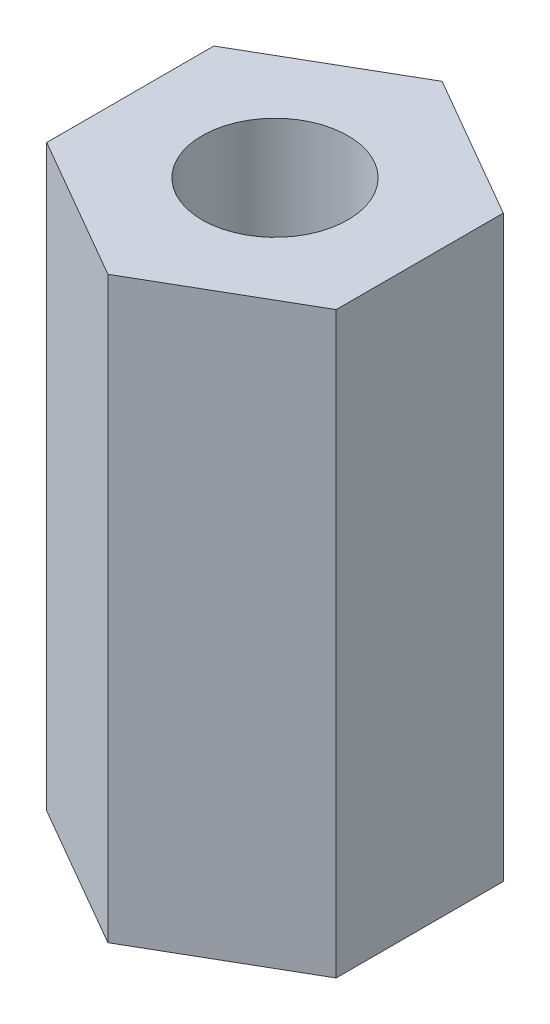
ISO-10303-21;
HEADER;
FILE_DESCRIPTION(('STEP AP214'),'2;1');
FILE_NAME('part.step','',(''),(''),'','','');
FILE_SCHEMA(('AUTOMOTIVE_DESIGN { 1 0 10303 214 1 1 1 1 }'));
ENDSEC;
DATA;
#1=APPLICATION_CONTEXT('core data for automotive mechanical design processes');
#2=APPLICATION_PROTOCOL_DEFINITION('international standard','automotive_design',2000,#1);
#3=PRODUCT_CONTEXT('',#1,'mechanical');
#4=PRODUCT('Part','Part','',(#3));
#5=PRODUCT_RELATED_PRODUCT_CATEGORY('part','',(#4));
#6=PRODUCT_DEFINITION_FORMATION('','',#4);
#7=PRODUCT_DEFINITION_CONTEXT('part definition',#1,'design');
#8=PRODUCT_DEFINITION('design','',#6,#7);
#9=PRODUCT_DEFINITION_SHAPE('','',#8);
#10=(LENGTH_UNIT() NAMED_UNIT(*) SI_UNIT(.MILLI.,.METRE.));
#11=(NAMED_UNIT(*) PLANE_ANGLE_UNIT() SI_UNIT($,.RADIAN.));
#12=(NAMED_UNIT(*) SI_UNIT($,.STERADIAN.) SOLID_ANGLE_UNIT());
#13=UNCERTAINTY_MEASURE_WITH_UNIT(LENGTH_MEASURE(1.E-05),#10,'distance_accuracy_value','');
#14=(GEOMETRIC_REPRESENTATION_CONTEXT(3) GLOBAL_UNCERTAINTY_ASSIGNED_CONTEXT((#13)) GLOBAL_UNIT_ASSIGNED_CONTEXT((#10,
#11,#12)) REPRESENTATION_CONTEXT('',''));
#15=CARTESIAN_POINT('',(0.,0.,0.));
#16=DIRECTION('',(0.,0.,1.));
#17=DIRECTION('',(1.,0.,0.));
#18=AXIS2_PLACEMENT_3D('',#15,#16,#17);
#19=CARTESIAN_POINT('',(12.7,25.4,0.));
#20=DIRECTION('',(0.,-1.,0.));
#21=DIRECTION('',(0.,0.,-1.));
#22=AXIS2_PLACEMENT_3D('',#19,#20,#21);
#23=PLANE('',#22);
#24=DIRECTION('',(-0.866025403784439,0.,-0.5));
#25=VECTOR('',#24,1.);
#26=CARTESIAN_POINT('',(6.35,25.4,-3.66617420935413));
#27=LINE('',#26,#25);
#28=CARTESIAN_POINT('',(6.35,25.4,-3.66617420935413));
#29=VERTEX_POINT('',#28);
#30=CARTESIAN_POINT('',(0.,25.4,-7.33234841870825));
#31=VERTEX_POINT('',#30);
#32=EDGE_CURVE('E120',#29,#31,#27,.T.);
#33=ORIENTED_EDGE('',*,*,#32,.T.);
#34=DIRECTION('',(-0.866025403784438,0.,0.5));
#35=VECTOR('',#34,1.);
#36=CARTESIAN_POINT('',(0.,25.4,-7.33234841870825));
#37=LINE('',#36,#35);
#38=CARTESIAN_POINT('',(-6.35,25.4,-3.66617420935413));
#39=VERTEX_POINT('',#38);
#40=EDGE_CURVE('E101',#31,#39,#37,.T.);
#41=ORIENTED_EDGE('',*,*,#40,.T.);
#42=DIRECTION('',(0.,0.,1.));
#43=VECTOR('',#42,1.);
#44=CARTESIAN_POINT('',(-6.35,25.4,-3.66617420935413));
#45=LINE('',#44,#43);
#46=CARTESIAN_POINT('',(-6.35,25.4,3.66617420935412));
#47=VERTEX_POINT('',#46);
#48=EDGE_CURVE('E123',#39,#47,#45,.T.);
#49=ORIENTED_EDGE('',*,*,#48,.T.);
#50=DIRECTION('',(0.866025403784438,0.,0.5));
#51=VECTOR('',#50,1.);
#52=CARTESIAN_POINT('',(-6.35,25.4,3.66617420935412));
#53=LINE('',#52,#51);
#54=CARTESIAN_POINT('',(0.,25.4,7.33234841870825));
#55=VERTEX_POINT('',#54);
#56=EDGE_CURVE('E125',#47,#55,#53,.T.);
#57=ORIENTED_EDGE('',*,*,#56,.T.);
#58=DIRECTION('',(0.866025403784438,0.,-0.5));
#59=VECTOR('',#58,1.);
#60=CARTESIAN_POINT('',(0.,25.4,7.33234841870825));
#61=LINE('',#60,#59);
#62=CARTESIAN_POINT('',(6.35,25.4,3.66617420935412));
#63=VERTEX_POINT('',#62);
#64=EDGE_CURVE('E54',#55,#63,#61,.T.);
#65=ORIENTED_EDGE('',*,*,#64,.T.);
#66=DIRECTION('',(0.,0.,-1.));
#67=VECTOR('',#66,1.);
#68=CARTESIAN_POINT('',(6.35,25.4,3.66617420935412));
#69=LINE('',#68,#67);
#70=EDGE_CURVE('E49',#63,#29,#69,.T.);
#71=ORIENTED_EDGE('',*,*,#70,.T.);
#72=EDGE_LOOP('',(#33,#41,#49,#57,#65,#71));
#73=FACE_BOUND('',#72,.T.);
#74=CARTESIAN_POINT('',(0.,25.4,0.));
#75=DIRECTION('',(0.,1.,0.));
#76=DIRECTION('',(0.,0.,1.));
#77=AXIS2_PLACEMENT_3D('',#74,#75,#76);
#78=CIRCLE('',#77,3.2004);
#79=CARTESIAN_POINT('',(0.,25.4,3.2004));
#80=VERTEX_POINT('',#79);
#81=EDGE_CURVE('E106',#80,#80,#78,.T.);
#82=ORIENTED_EDGE('',*,*,#81,.F.);
#83=EDGE_LOOP('',(#82));
#84=FACE_BOUND('',#83,.T.);
#85=ADVANCED_FACE('F34',(#73,#84),#23,.F.);
#86=CARTESIAN_POINT('',(12.7,0.,0.));
#87=DIRECTION('',(0.,-1.,0.));
#88=DIRECTION('',(0.,0.,-1.));
#89=AXIS2_PLACEMENT_3D('',#86,#87,#88);
#90=PLANE('',#89);
#91=DIRECTION('',(-0.866025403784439,0.,-0.5));
#92=VECTOR('',#91,1.);
#93=CARTESIAN_POINT('',(6.35,0.,-3.66617420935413));
#94=LINE('',#93,#92);
#95=CARTESIAN_POINT('',(6.35,0.,-3.66617420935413));
#96=VERTEX_POINT('',#95);
#97=CARTESIAN_POINT('',(0.,0.,-7.33234841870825));
#98=VERTEX_POINT('',#97);
#99=EDGE_CURVE('E92',#96,#98,#94,.T.);
#100=ORIENTED_EDGE('',*,*,#99,.F.);
#101=DIRECTION('',(0.,0.,-1.));
#102=VECTOR('',#101,1.);
#103=CARTESIAN_POINT('',(6.35,0.,3.66617420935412));
#104=LINE('',#103,#102);
#105=CARTESIAN_POINT('',(6.35,0.,3.66617420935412));
#106=VERTEX_POINT('',#105);
#107=EDGE_CURVE('E118',#106,#96,#104,.T.);
#108=ORIENTED_EDGE('',*,*,#107,.F.);
#109=DIRECTION('',(0.866025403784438,0.,-0.5));
#110=VECTOR('',#109,1.);
#111=CARTESIAN_POINT('',(0.,0.,7.33234841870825));
#112=LINE('',#111,#110);
#113=CARTESIAN_POINT('',(0.,0.,7.33234841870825));
#114=VERTEX_POINT('',#113);
#115=EDGE_CURVE('E116',#114,#106,#112,.T.);
#116=ORIENTED_EDGE('',*,*,#115,.F.);
#117=DIRECTION('',(0.866025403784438,0.,0.5));
#118=VECTOR('',#117,1.);
#119=CARTESIAN_POINT('',(-6.35,0.,3.66617420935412));
#120=LINE('',#119,#118);
#121=CARTESIAN_POINT('',(-6.35,0.,3.66617420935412));
#122=VERTEX_POINT('',#121);
#123=EDGE_CURVE('E114',#122,#114,#120,.T.);
#124=ORIENTED_EDGE('',*,*,#123,.F.);
#125=DIRECTION('',(0.,0.,1.));
#126=VECTOR('',#125,1.);
#127=CARTESIAN_POINT('',(-6.35,0.,-3.66617420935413));
#128=LINE('',#127,#126);
#129=CARTESIAN_POINT('',(-6.35,0.,-3.66617420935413));
#130=VERTEX_POINT('',#129);
#131=EDGE_CURVE('E94',#130,#122,#128,.T.);
#132=ORIENTED_EDGE('',*,*,#131,.F.);
#133=DIRECTION('',(-0.866025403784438,0.,0.5));
#134=VECTOR('',#133,1.);
#135=CARTESIAN_POINT('',(0.,0.,-7.33234841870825));
#136=LINE('',#135,#134);
#137=EDGE_CURVE('E87',#98,#130,#136,.T.);
#138=ORIENTED_EDGE('',*,*,#137,.F.);
#139=EDGE_LOOP('',(#100,#108,#116,#124,#132,#138));
#140=FACE_BOUND('',#139,.T.);
#141=CARTESIAN_POINT('',(0.,0.,0.));
#142=DIRECTION('',(0.,1.,0.));
#143=DIRECTION('',(0.,0.,1.));
#144=AXIS2_PLACEMENT_3D('',#141,#142,#143);
#145=CIRCLE('',#144,3.2004);
#146=CARTESIAN_POINT('',(0.,0.,3.2004));
#147=VERTEX_POINT('',#146);
#148=EDGE_CURVE('E109',#147,#147,#145,.T.);
#149=ORIENTED_EDGE('',*,*,#148,.T.);
#150=EDGE_LOOP('',(#149));
#151=FACE_BOUND('',#150,.T.);
#152=ADVANCED_FACE('F88',(#140,#151),#90,.T.);
#153=CARTESIAN_POINT('',(6.35,25.4,-3.66617420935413));
#154=DIRECTION('',(-0.5,0.,0.866025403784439));
#155=DIRECTION('',(0.866025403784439,0.,0.5));
#156=AXIS2_PLACEMENT_3D('',#153,#154,#155);
#157=PLANE('',#156);
#158=ORIENTED_EDGE('',*,*,#99,.T.);
#159=DIRECTION('',(0.,-1.,0.));
#160=VECTOR('',#159,1.);
#161=CARTESIAN_POINT('',(0.,25.4,-7.33234841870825));
#162=LINE('',#161,#160);
#163=EDGE_CURVE('E11',#31,#98,#162,.T.);
#164=ORIENTED_EDGE('',*,*,#163,.F.);
#165=ORIENTED_EDGE('',*,*,#32,.F.);
#166=DIRECTION('',(0.,-1.,0.));
#167=VECTOR('',#166,1.);
#168=CARTESIAN_POINT('',(6.35,25.4,-3.66617420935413));
#169=LINE('',#168,#167);
#170=EDGE_CURVE('E105',#29,#96,#169,.T.);
#171=ORIENTED_EDGE('',*,*,#170,.T.);
#172=EDGE_LOOP('',(#158,#164,#165,#171));
#173=FACE_BOUND('',#172,.T.);
#174=ADVANCED_FACE('F36',(#173),#157,.F.);
#175=CARTESIAN_POINT('',(0.,25.4,-7.33234841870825));
#176=DIRECTION('',(0.5,0.,0.866025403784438));
#177=DIRECTION('',(0.866025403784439,0.,-0.5));
#178=AXIS2_PLACEMENT_3D('',#175,#176,#177);
#179=PLANE('',#178);
#180=ORIENTED_EDGE('',*,*,#137,.T.);
#181=DIRECTION('',(0.,-1.,0.));
#182=VECTOR('',#181,1.);
#183=CARTESIAN_POINT('',(-6.35,25.4,-3.66617420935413));
#184=LINE('',#183,#182);
#185=EDGE_CURVE('E42',#39,#130,#184,.T.);
#186=ORIENTED_EDGE('',*,*,#185,.F.);
#187=ORIENTED_EDGE('',*,*,#40,.F.);
#188=ORIENTED_EDGE('',*,*,#163,.T.);
#189=EDGE_LOOP('',(#180,#186,#187,#188));
#190=FACE_BOUND('',#189,.T.);
#191=ADVANCED_FACE('F100',(#190),#179,.F.);
#192=CARTESIAN_POINT('',(-6.35,25.4,-3.66617420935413));
#193=DIRECTION('',(1.,0.,0.));
#194=DIRECTION('',(0.,0.,-1.));
#195=AXIS2_PLACEMENT_3D('',#192,#193,#194);
#196=PLANE('',#195);
#197=ORIENTED_EDGE('',*,*,#131,.T.);
#198=DIRECTION('',(0.,-1.,0.));
#199=VECTOR('',#198,1.);
#200=CARTESIAN_POINT('',(-6.35,25.4,3.66617420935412));
#201=LINE('',#200,#199);
#202=EDGE_CURVE('E136',#47,#122,#201,.T.);
#203=ORIENTED_EDGE('',*,*,#202,.F.);
#204=ORIENTED_EDGE('',*,*,#48,.F.);
#205=ORIENTED_EDGE('',*,*,#185,.T.);
#206=EDGE_LOOP('',(#197,#203,#204,#205));
#207=FACE_BOUND('',#206,.T.);
#208=ADVANCED_FACE('F140',(#207),#196,.F.);
#209=CARTESIAN_POINT('',(-6.35,25.4,3.66617420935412));
#210=DIRECTION('',(0.5,0.,-0.866025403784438));
#211=DIRECTION('',(-0.866025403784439,0.,-0.5));
#212=AXIS2_PLACEMENT_3D('',#209,#210,#211);
#213=PLANE('',#212);
#214=ORIENTED_EDGE('',*,*,#123,.T.);
#215=DIRECTION('',(0.,-1.,0.));
#216=VECTOR('',#215,1.);
#217=CARTESIAN_POINT('',(0.,25.4,7.33234841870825));
#218=LINE('',#217,#216);
#219=EDGE_CURVE('E133',#55,#114,#218,.T.);
#220=ORIENTED_EDGE('',*,*,#219,.F.);
#221=ORIENTED_EDGE('',*,*,#56,.F.);
#222=ORIENTED_EDGE('',*,*,#202,.T.);
#223=EDGE_LOOP('',(#214,#220,#221,#222));
#224=FACE_BOUND('',#223,.T.);
#225=ADVANCED_FACE('F146',(#224),#213,.F.);
#226=CARTESIAN_POINT('',(0.,25.4,7.33234841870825));
#227=DIRECTION('',(-0.5,0.,-0.866025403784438));
#228=DIRECTION('',(-0.866025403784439,0.,0.5));
#229=AXIS2_PLACEMENT_3D('',#226,#227,#228);
#230=PLANE('',#229);
#231=ORIENTED_EDGE('',*,*,#115,.T.);
#232=DIRECTION('',(0.,-1.,0.));
#233=VECTOR('',#232,1.);
#234=CARTESIAN_POINT('',(6.35,25.4,3.66617420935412));
#235=LINE('',#234,#233);
#236=EDGE_CURVE('E130',#63,#106,#235,.T.);
#237=ORIENTED_EDGE('',*,*,#236,.F.);
#238=ORIENTED_EDGE('',*,*,#64,.F.);
#239=ORIENTED_EDGE('',*,*,#219,.T.);
#240=EDGE_LOOP('',(#231,#237,#238,#239));
#241=FACE_BOUND('',#240,.T.);
#242=ADVANCED_FACE('F149',(#241),#230,.F.);
#243=CARTESIAN_POINT('',(6.35,25.4,3.66617420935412));
#244=DIRECTION('',(-1.,0.,0.));
#245=DIRECTION('',(0.,0.,1.));
#246=AXIS2_PLACEMENT_3D('',#243,#244,#245);
#247=PLANE('',#246);
#248=ORIENTED_EDGE('',*,*,#107,.T.);
#249=ORIENTED_EDGE('',*,*,#170,.F.);
#250=ORIENTED_EDGE('',*,*,#70,.F.);
#251=ORIENTED_EDGE('',*,*,#236,.T.);
#252=EDGE_LOOP('',(#248,#249,#250,#251));
#253=FACE_BOUND('',#252,.T.);
#254=ADVANCED_FACE('F151',(#253),#247,.F.);
#255=CARTESIAN_POINT('',(0.,25.4,0.));
#256=DIRECTION('',(0.,-1.,0.));
#257=DIRECTION('',(0.,0.,-1.));
#258=AXIS2_PLACEMENT_3D('',#255,#256,#257);
#259=CYLINDRICAL_SURFACE('',#258,3.2004);
#260=ORIENTED_EDGE('',*,*,#81,.T.);
#261=EDGE_LOOP('',(#260));
#262=FACE_BOUND('',#261,.T.);
#263=ORIENTED_EDGE('',*,*,#148,.F.);
#264=EDGE_LOOP('',(#263));
#265=FACE_BOUND('',#264,.T.);
#266=ADVANCED_FACE('F153',(#262,#265),#259,.F.);
#267=CLOSED_SHELL('',(#85,#152,#174,#191,#208,#225,#242,#254,#266));
#268=MANIFOLD_SOLID_BREP('B2',#267);
#269=ADVANCED_BREP_SHAPE_REPRESENTATION('',(#18,#268),#14);
#270=SHAPE_DEFINITION_REPRESENTATION(#9,#269);
ENDSEC;
END-ISO-10303-21;
